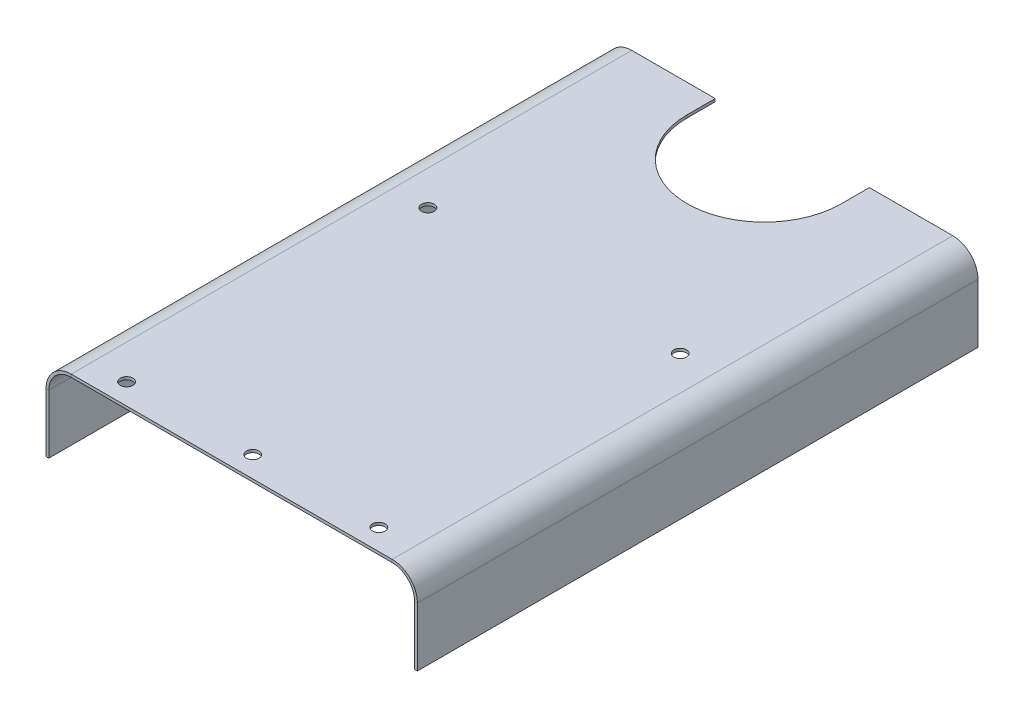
ISO-10303-21;
HEADER;
FILE_DESCRIPTION(('STEP AP214'),'2;1');
FILE_NAME('part.step','',(''),(''),'','','');
FILE_SCHEMA(('AUTOMOTIVE_DESIGN { 1 0 10303 214 1 1 1 1 }'));
ENDSEC;
DATA;
#1=APPLICATION_CONTEXT('core data for automotive mechanical design processes');
#2=APPLICATION_PROTOCOL_DEFINITION('international standard','automotive_design',2000,#1);
#3=PRODUCT_CONTEXT('',#1,'mechanical');
#4=PRODUCT('Part','Part','',(#3));
#5=PRODUCT_RELATED_PRODUCT_CATEGORY('part','',(#4));
#6=PRODUCT_DEFINITION_FORMATION('','',#4);
#7=PRODUCT_DEFINITION_CONTEXT('part definition',#1,'design');
#8=PRODUCT_DEFINITION('design','',#6,#7);
#9=PRODUCT_DEFINITION_SHAPE('','',#8);
#10=(LENGTH_UNIT() NAMED_UNIT(*) SI_UNIT(.MILLI.,.METRE.));
#11=(NAMED_UNIT(*) PLANE_ANGLE_UNIT() SI_UNIT($,.RADIAN.));
#12=(NAMED_UNIT(*) SI_UNIT($,.STERADIAN.) SOLID_ANGLE_UNIT());
#13=UNCERTAINTY_MEASURE_WITH_UNIT(LENGTH_MEASURE(1.E-05),#10,'distance_accuracy_value','');
#14=(GEOMETRIC_REPRESENTATION_CONTEXT(3) GLOBAL_UNCERTAINTY_ASSIGNED_CONTEXT((#13)) GLOBAL_UNIT_ASSIGNED_CONTEXT((#10,
#11,#12)) REPRESENTATION_CONTEXT('',''));
#15=CARTESIAN_POINT('',(0.,0.,0.));
#16=DIRECTION('',(0.,0.,1.));
#17=DIRECTION('',(1.,0.,0.));
#18=AXIS2_PLACEMENT_3D('',#15,#16,#17);
#19=CARTESIAN_POINT('',(130.5,-18.,0.));
#20=DIRECTION('',(0.,0.,-1.));
#21=DIRECTION('',(-1.,0.,0.));
#22=AXIS2_PLACEMENT_3D('',#19,#20,#21);
#23=PLANE('',#22);
#24=DIRECTION('',(-1.,0.,0.));
#25=VECTOR('',#24,1.);
#26=CARTESIAN_POINT('',(-132.5,0.,0.));
#27=LINE('',#26,#25);
#28=CARTESIAN_POINT('',(-55.,0.,0.));
#29=VERTEX_POINT('',#28);
#30=CARTESIAN_POINT('',(-114.5,0.,0.));
#31=VERTEX_POINT('',#30);
#32=EDGE_CURVE('E157',#29,#31,#27,.T.);
#33=ORIENTED_EDGE('',*,*,#32,.F.);
#34=DIRECTION('',(0.,-1.,0.));
#35=VECTOR('',#34,1.);
#36=CARTESIAN_POINT('',(-55.0000000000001,626.943183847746,0.));
#37=LINE('',#36,#35);
#38=CARTESIAN_POINT('',(-55.,-1.99999999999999,0.));
#39=VERTEX_POINT('',#38);
#40=EDGE_CURVE('E291',#29,#39,#37,.T.);
#41=ORIENTED_EDGE('',*,*,#40,.T.);
#42=DIRECTION('',(-1.,0.,0.));
#43=VECTOR('',#42,1.);
#44=CARTESIAN_POINT('',(-132.5,-2.,0.));
#45=LINE('',#44,#43);
#46=CARTESIAN_POINT('',(-114.5,-2.,0.));
#47=VERTEX_POINT('',#46);
#48=EDGE_CURVE('E241',#39,#47,#45,.T.);
#49=ORIENTED_EDGE('',*,*,#48,.T.);
#50=DIRECTION('',(0.,1.,0.));
#51=VECTOR('',#50,1.);
#52=CARTESIAN_POINT('',(-114.5,-2.,0.));
#53=LINE('',#52,#51);
#54=EDGE_CURVE('E188',#47,#31,#53,.T.);
#55=ORIENTED_EDGE('',*,*,#54,.T.);
#56=EDGE_LOOP('',(#33,#41,#49,#55));
#57=FACE_BOUND('',#56,.T.);
#58=ADVANCED_FACE('F34',(#57),#23,.T.);
#59=CARTESIAN_POINT('',(114.5,-1.99999999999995,0.));
#60=VERTEX_POINT('',#59);
#61=CARTESIAN_POINT('',(55.,-1.99999999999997,0.));
#62=VERTEX_POINT('',#61);
#63=EDGE_CURVE('E164',#60,#62,#45,.T.);
#64=ORIENTED_EDGE('',*,*,#63,.T.);
#65=DIRECTION('',(0.,-1.,0.));
#66=VECTOR('',#65,1.);
#67=CARTESIAN_POINT('',(54.9999999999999,626.943183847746,0.));
#68=LINE('',#67,#66);
#69=CARTESIAN_POINT('',(55.,0.,0.));
#70=VERTEX_POINT('',#69);
#71=EDGE_CURVE('E161',#70,#62,#68,.T.);
#72=ORIENTED_EDGE('',*,*,#71,.F.);
#73=CARTESIAN_POINT('',(114.5,0.,0.));
#74=VERTEX_POINT('',#73);
#75=EDGE_CURVE('E146',#74,#70,#27,.T.);
#76=ORIENTED_EDGE('',*,*,#75,.F.);
#77=DIRECTION('',(0.,-1.,0.));
#78=VECTOR('',#77,1.);
#79=CARTESIAN_POINT('',(114.5,0.,0.));
#80=LINE('',#79,#78);
#81=EDGE_CURVE('E178',#74,#60,#80,.T.);
#82=ORIENTED_EDGE('',*,*,#81,.T.);
#83=EDGE_LOOP('',(#64,#72,#76,#82));
#84=FACE_BOUND('',#83,.T.);
#85=ADVANCED_FACE('F162',(#84),#23,.T.);
#86=CARTESIAN_POINT('',(-132.5,-2.,400.));
#87=DIRECTION('',(0.,-1.,0.));
#88=DIRECTION('',(1.,0.,0.));
#89=AXIS2_PLACEMENT_3D('',#86,#87,#88);
#90=PLANE('',#89);
#91=CARTESIAN_POINT('',(90.,-1.99999999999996,385.));
#92=DIRECTION('',(0.,-1.,0.));
#93=DIRECTION('',(1.,0.,0.));
#94=AXIS2_PLACEMENT_3D('',#91,#92,#93);
#95=CIRCLE('',#94,4.50000000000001);
#96=CARTESIAN_POINT('',(94.5,-1.99999999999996,385.));
#97=VERTEX_POINT('',#96);
#98=EDGE_CURVE('E320',#97,#97,#95,.T.);
#99=ORIENTED_EDGE('',*,*,#98,.F.);
#100=EDGE_LOOP('',(#99));
#101=FACE_BOUND('',#100,.T.);
#102=CARTESIAN_POINT('',(0.,-1.99999999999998,385.));
#103=DIRECTION('',(0.,-1.,0.));
#104=DIRECTION('',(1.,0.,0.));
#105=AXIS2_PLACEMENT_3D('',#102,#103,#104);
#106=CIRCLE('',#105,4.50000000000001);
#107=CARTESIAN_POINT('',(4.50000000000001,-1.99999999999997,385.));
#108=VERTEX_POINT('',#107);
#109=EDGE_CURVE('E314',#108,#108,#106,.T.);
#110=ORIENTED_EDGE('',*,*,#109,.F.);
#111=EDGE_LOOP('',(#110));
#112=FACE_BOUND('',#111,.T.);
#113=CARTESIAN_POINT('',(-90.,-1.99999999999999,385.));
#114=DIRECTION('',(0.,-1.,0.));
#115=DIRECTION('',(1.,0.,0.));
#116=AXIS2_PLACEMENT_3D('',#113,#114,#115);
#117=CIRCLE('',#116,4.50000000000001);
#118=CARTESIAN_POINT('',(-85.5,-1.99999999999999,385.));
#119=VERTEX_POINT('',#118);
#120=EDGE_CURVE('E308',#119,#119,#117,.T.);
#121=ORIENTED_EDGE('',*,*,#120,.F.);
#122=EDGE_LOOP('',(#121));
#123=FACE_BOUND('',#122,.T.);
#124=CARTESIAN_POINT('',(90.,-1.99999999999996,170.));
#125=DIRECTION('',(0.,-1.,0.));
#126=DIRECTION('',(1.,0.,0.));
#127=AXIS2_PLACEMENT_3D('',#124,#125,#126);
#128=CIRCLE('',#127,4.50000000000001);
#129=CARTESIAN_POINT('',(94.5,-1.99999999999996,170.));
#130=VERTEX_POINT('',#129);
#131=EDGE_CURVE('E302',#130,#130,#128,.T.);
#132=ORIENTED_EDGE('',*,*,#131,.F.);
#133=EDGE_LOOP('',(#132));
#134=FACE_BOUND('',#133,.T.);
#135=CARTESIAN_POINT('',(-90.,-1.99999999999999,170.));
#136=DIRECTION('',(0.,-1.,0.));
#137=DIRECTION('',(1.,0.,0.));
#138=AXIS2_PLACEMENT_3D('',#135,#136,#137);
#139=CIRCLE('',#138,4.50000000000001);
#140=CARTESIAN_POINT('',(-85.5,-1.99999999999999,170.));
#141=VERTEX_POINT('',#140);
#142=EDGE_CURVE('E295',#141,#141,#139,.T.);
#143=ORIENTED_EDGE('',*,*,#142,.F.);
#144=EDGE_LOOP('',(#143));
#145=FACE_BOUND('',#144,.T.);
#146=ORIENTED_EDGE('',*,*,#48,.F.);
#147=DIRECTION('',(0.,0.,1.));
#148=VECTOR('',#147,1.);
#149=CARTESIAN_POINT('',(-55.,-1.99999999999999,400.));
#150=LINE('',#149,#148);
#151=CARTESIAN_POINT('',(-55.,-2.00000000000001,20.));
#152=VERTEX_POINT('',#151);
#153=EDGE_CURVE('E49',#39,#152,#150,.T.);
#154=ORIENTED_EDGE('',*,*,#153,.T.);
#155=CARTESIAN_POINT('',(0.,-2.,20.));
#156=DIRECTION('',(0.,-1.,0.));
#157=DIRECTION('',(1.,0.,0.));
#158=AXIS2_PLACEMENT_3D('',#155,#156,#157);
#159=CIRCLE('',#158,55.);
#160=CARTESIAN_POINT('',(55.,-1.99999999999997,20.));
#161=VERTEX_POINT('',#160);
#162=EDGE_CURVE('E53',#152,#161,#159,.F.);
#163=ORIENTED_EDGE('',*,*,#162,.T.);
#164=DIRECTION('',(0.,0.,-1.));
#165=VECTOR('',#164,1.);
#166=CARTESIAN_POINT('',(55.,-1.99999999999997,400.));
#167=LINE('',#166,#165);
#168=EDGE_CURVE('E289',#161,#62,#167,.T.);
#169=ORIENTED_EDGE('',*,*,#168,.T.);
#170=ORIENTED_EDGE('',*,*,#63,.F.);
#171=DIRECTION('',(0.,0.,-1.));
#172=VECTOR('',#171,1.);
#173=CARTESIAN_POINT('',(114.5,-1.99999999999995,400.));
#174=LINE('',#173,#172);
#175=CARTESIAN_POINT('',(114.5,-1.99999999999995,400.));
#176=VERTEX_POINT('',#175);
#177=EDGE_CURVE('E201',#176,#60,#174,.T.);
#178=ORIENTED_EDGE('',*,*,#177,.F.);
#179=DIRECTION('',(-1.,0.,0.));
#180=VECTOR('',#179,1.);
#181=CARTESIAN_POINT('',(-132.5,-2.,400.));
#182=LINE('',#181,#180);
#183=CARTESIAN_POINT('',(-114.5,-2.,400.));
#184=VERTEX_POINT('',#183);
#185=EDGE_CURVE('E274',#176,#184,#182,.T.);
#186=ORIENTED_EDGE('',*,*,#185,.T.);
#187=DIRECTION('',(0.,0.,-1.));
#188=VECTOR('',#187,1.);
#189=CARTESIAN_POINT('',(-114.5,-2.,400.));
#190=LINE('',#189,#188);
#191=EDGE_CURVE('E198',#184,#47,#190,.T.);
#192=ORIENTED_EDGE('',*,*,#191,.T.);
#193=EDGE_LOOP('',(#146,#154,#163,#169,#170,#178,#186,#192));
#194=FACE_BOUND('',#193,.T.);
#195=ADVANCED_FACE('F331',(#101,#112,#123,#134,#145,#194),#90,.T.);
#196=CARTESIAN_POINT('',(-132.5,0.,400.));
#197=DIRECTION('',(0.,-1.,0.));
#198=DIRECTION('',(1.,0.,0.));
#199=AXIS2_PLACEMENT_3D('',#196,#197,#198);
#200=PLANE('',#199);
#201=CARTESIAN_POINT('',(90.,0.,385.));
#202=DIRECTION('',(0.,1.,0.));
#203=DIRECTION('',(-1.,0.,0.));
#204=AXIS2_PLACEMENT_3D('',#201,#202,#203);
#205=CIRCLE('',#204,4.50000000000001);
#206=CARTESIAN_POINT('',(85.5,0.,385.));
#207=VERTEX_POINT('',#206);
#208=EDGE_CURVE('E323',#207,#207,#205,.T.);
#209=ORIENTED_EDGE('',*,*,#208,.F.);
#210=EDGE_LOOP('',(#209));
#211=FACE_BOUND('',#210,.T.);
#212=CARTESIAN_POINT('',(0.,0.,385.));
#213=DIRECTION('',(0.,1.,0.));
#214=DIRECTION('',(-1.,0.,0.));
#215=AXIS2_PLACEMENT_3D('',#212,#213,#214);
#216=CIRCLE('',#215,4.50000000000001);
#217=CARTESIAN_POINT('',(-4.50000000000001,0.,385.));
#218=VERTEX_POINT('',#217);
#219=EDGE_CURVE('E317',#218,#218,#216,.T.);
#220=ORIENTED_EDGE('',*,*,#219,.F.);
#221=EDGE_LOOP('',(#220));
#222=FACE_BOUND('',#221,.T.);
#223=CARTESIAN_POINT('',(-90.,0.,385.));
#224=DIRECTION('',(0.,1.,0.));
#225=DIRECTION('',(-1.,0.,0.));
#226=AXIS2_PLACEMENT_3D('',#223,#224,#225);
#227=CIRCLE('',#226,4.50000000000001);
#228=CARTESIAN_POINT('',(-94.5,0.,385.));
#229=VERTEX_POINT('',#228);
#230=EDGE_CURVE('E311',#229,#229,#227,.T.);
#231=ORIENTED_EDGE('',*,*,#230,.F.);
#232=EDGE_LOOP('',(#231));
#233=FACE_BOUND('',#232,.T.);
#234=CARTESIAN_POINT('',(90.,0.,170.));
#235=DIRECTION('',(0.,1.,0.));
#236=DIRECTION('',(-1.,0.,0.));
#237=AXIS2_PLACEMENT_3D('',#234,#235,#236);
#238=CIRCLE('',#237,4.50000000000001);
#239=CARTESIAN_POINT('',(85.5,0.,170.));
#240=VERTEX_POINT('',#239);
#241=EDGE_CURVE('E305',#240,#240,#238,.T.);
#242=ORIENTED_EDGE('',*,*,#241,.F.);
#243=EDGE_LOOP('',(#242));
#244=FACE_BOUND('',#243,.T.);
#245=CARTESIAN_POINT('',(-90.,0.,170.));
#246=DIRECTION('',(0.,1.,0.));
#247=DIRECTION('',(-1.,0.,0.));
#248=AXIS2_PLACEMENT_3D('',#245,#246,#247);
#249=CIRCLE('',#248,4.50000000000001);
#250=CARTESIAN_POINT('',(-94.5,0.,170.));
#251=VERTEX_POINT('',#250);
#252=EDGE_CURVE('E299',#251,#251,#249,.T.);
#253=ORIENTED_EDGE('',*,*,#252,.F.);
#254=EDGE_LOOP('',(#253));
#255=FACE_BOUND('',#254,.T.);
#256=DIRECTION('',(0.,0.,1.));
#257=VECTOR('',#256,1.);
#258=CARTESIAN_POINT('',(-55.,0.,400.));
#259=LINE('',#258,#257);
#260=CARTESIAN_POINT('',(-55.,0.,20.));
#261=VERTEX_POINT('',#260);
#262=EDGE_CURVE('E11',#29,#261,#259,.T.);
#263=ORIENTED_EDGE('',*,*,#262,.F.);
#264=ORIENTED_EDGE('',*,*,#32,.T.);
#265=DIRECTION('',(0.,0.,-1.));
#266=VECTOR('',#265,1.);
#267=CARTESIAN_POINT('',(-114.5,0.,400.));
#268=LINE('',#267,#266);
#269=CARTESIAN_POINT('',(-114.5,0.,400.));
#270=VERTEX_POINT('',#269);
#271=EDGE_CURVE('E215',#270,#31,#268,.T.);
#272=ORIENTED_EDGE('',*,*,#271,.F.);
#273=DIRECTION('',(-1.,0.,0.));
#274=VECTOR('',#273,1.);
#275=CARTESIAN_POINT('',(-132.5,0.,400.));
#276=LINE('',#275,#274);
#277=CARTESIAN_POINT('',(114.5,0.,400.));
#278=VERTEX_POINT('',#277);
#279=EDGE_CURVE('E256',#278,#270,#276,.T.);
#280=ORIENTED_EDGE('',*,*,#279,.F.);
#281=DIRECTION('',(0.,0.,-1.));
#282=VECTOR('',#281,1.);
#283=CARTESIAN_POINT('',(114.5,0.,400.));
#284=LINE('',#283,#282);
#285=EDGE_CURVE('E154',#278,#74,#284,.T.);
#286=ORIENTED_EDGE('',*,*,#285,.T.);
#287=ORIENTED_EDGE('',*,*,#75,.T.);
#288=DIRECTION('',(0.,0.,-1.));
#289=VECTOR('',#288,1.);
#290=CARTESIAN_POINT('',(55.,0.,400.));
#291=LINE('',#290,#289);
#292=CARTESIAN_POINT('',(55.,0.,20.));
#293=VERTEX_POINT('',#292);
#294=EDGE_CURVE('E150',#293,#70,#291,.T.);
#295=ORIENTED_EDGE('',*,*,#294,.F.);
#296=CARTESIAN_POINT('',(0.,0.,20.));
#297=DIRECTION('',(0.,-1.,0.));
#298=DIRECTION('',(1.,0.,0.));
#299=AXIS2_PLACEMENT_3D('',#296,#297,#298);
#300=CIRCLE('',#299,55.);
#301=EDGE_CURVE('E42',#261,#293,#300,.F.);
#302=ORIENTED_EDGE('',*,*,#301,.F.);
#303=EDGE_LOOP('',(#263,#264,#272,#280,#286,#287,#295,#302));
#304=FACE_BOUND('',#303,.T.);
#305=ADVANCED_FACE('F148',(#211,#222,#233,#244,#255,#304),#200,.F.);
#306=CARTESIAN_POINT('',(132.5,-18.,400.));
#307=DIRECTION('',(0.,0.,1.));
#308=DIRECTION('',(1.,0.,0.));
#309=AXIS2_PLACEMENT_3D('',#306,#307,#308);
#310=PLANE('',#309);
#311=DIRECTION('',(-1.,0.,0.));
#312=VECTOR('',#311,1.);
#313=CARTESIAN_POINT('',(132.5,-18.,400.));
#314=LINE('',#313,#312);
#315=CARTESIAN_POINT('',(132.5,-18.,400.));
#316=VERTEX_POINT('',#315);
#317=CARTESIAN_POINT('',(130.5,-18.,400.));
#318=VERTEX_POINT('',#317);
#319=EDGE_CURVE('E172',#316,#318,#314,.T.);
#320=ORIENTED_EDGE('',*,*,#319,.F.);
#321=CARTESIAN_POINT('',(114.5,-18.,400.));
#322=DIRECTION('',(0.,0.,-1.));
#323=DIRECTION('',(-1.,0.,0.));
#324=AXIS2_PLACEMENT_3D('',#321,#322,#323);
#325=CIRCLE('',#324,18.);
#326=EDGE_CURVE('E259',#316,#278,#325,.F.);
#327=ORIENTED_EDGE('',*,*,#326,.T.);
#328=DIRECTION('',(0.,1.,0.));
#329=VECTOR('',#328,1.);
#330=CARTESIAN_POINT('',(114.5,-1.99999999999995,400.));
#331=LINE('',#330,#329);
#332=EDGE_CURVE('E174',#176,#278,#331,.T.);
#333=ORIENTED_EDGE('',*,*,#332,.F.);
#334=CARTESIAN_POINT('',(114.5,-18.,400.));
#335=DIRECTION('',(0.,0.,1.));
#336=DIRECTION('',(1.,0.,0.));
#337=AXIS2_PLACEMENT_3D('',#334,#335,#336);
#338=CIRCLE('',#337,16.);
#339=EDGE_CURVE('E271',#318,#176,#338,.T.);
#340=ORIENTED_EDGE('',*,*,#339,.F.);
#341=EDGE_LOOP('',(#320,#327,#333,#340));
#342=FACE_BOUND('',#341,.T.);
#343=ADVANCED_FACE('F36',(#342),#310,.T.);
#344=CARTESIAN_POINT('',(114.5,-1.99999999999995,400.));
#345=DIRECTION('',(0.,0.,1.));
#346=DIRECTION('',(1.,0.,0.));
#347=AXIS2_PLACEMENT_3D('',#344,#345,#346);
#348=PLANE('',#347);
#349=DIRECTION('',(0.,1.,0.));
#350=VECTOR('',#349,1.);
#351=CARTESIAN_POINT('',(132.5,0.,400.));
#352=LINE('',#351,#350);
#353=CARTESIAN_POINT('',(132.5,-60.,400.));
#354=VERTEX_POINT('',#353);
#355=EDGE_CURVE('E262',#354,#316,#352,.T.);
#356=ORIENTED_EDGE('',*,*,#355,.T.);
#357=ORIENTED_EDGE('',*,*,#319,.T.);
#358=DIRECTION('',(0.,1.,0.));
#359=VECTOR('',#358,1.);
#360=CARTESIAN_POINT('',(130.5,0.,400.));
#361=LINE('',#360,#359);
#362=CARTESIAN_POINT('',(130.5,-60.,400.));
#363=VERTEX_POINT('',#362);
#364=EDGE_CURVE('E268',#363,#318,#361,.T.);
#365=ORIENTED_EDGE('',*,*,#364,.F.);
#366=DIRECTION('',(-1.,0.,0.));
#367=VECTOR('',#366,1.);
#368=CARTESIAN_POINT('',(132.5,-60.,400.));
#369=LINE('',#368,#367);
#370=EDGE_CURVE('E265',#354,#363,#369,.T.);
#371=ORIENTED_EDGE('',*,*,#370,.F.);
#372=EDGE_LOOP('',(#356,#357,#365,#371));
#373=FACE_BOUND('',#372,.T.);
#374=ADVANCED_FACE('F368',(#373),#348,.T.);
#375=CARTESIAN_POINT('',(114.5,0.,0.));
#376=DIRECTION('',(0.,0.,-1.));
#377=DIRECTION('',(-1.,0.,0.));
#378=AXIS2_PLACEMENT_3D('',#375,#376,#377);
#379=PLANE('',#378);
#380=ORIENTED_EDGE('',*,*,#81,.F.);
#381=CARTESIAN_POINT('',(114.5,-18.,0.));
#382=DIRECTION('',(0.,0.,-1.));
#383=DIRECTION('',(-1.,0.,0.));
#384=AXIS2_PLACEMENT_3D('',#381,#382,#383);
#385=CIRCLE('',#384,18.);
#386=CARTESIAN_POINT('',(132.5,-18.,0.));
#387=VERTEX_POINT('',#386);
#388=EDGE_CURVE('E225',#387,#74,#385,.F.);
#389=ORIENTED_EDGE('',*,*,#388,.F.);
#390=DIRECTION('',(1.,0.,0.));
#391=VECTOR('',#390,1.);
#392=CARTESIAN_POINT('',(130.5,-18.,0.));
#393=LINE('',#392,#391);
#394=CARTESIAN_POINT('',(130.5,-18.,0.));
#395=VERTEX_POINT('',#394);
#396=EDGE_CURVE('E180',#395,#387,#393,.T.);
#397=ORIENTED_EDGE('',*,*,#396,.F.);
#398=CARTESIAN_POINT('',(114.5,-18.,0.));
#399=DIRECTION('',(0.,0.,1.));
#400=DIRECTION('',(1.,0.,0.));
#401=AXIS2_PLACEMENT_3D('',#398,#399,#400);
#402=CIRCLE('',#401,16.);
#403=EDGE_CURVE('E237',#395,#60,#402,.T.);
#404=ORIENTED_EDGE('',*,*,#403,.T.);
#405=EDGE_LOOP('',(#380,#389,#397,#404));
#406=FACE_BOUND('',#405,.T.);
#407=ADVANCED_FACE('F366',(#406),#379,.T.);
#408=CARTESIAN_POINT('',(-114.5,0.,400.));
#409=DIRECTION('',(0.,0.,1.));
#410=DIRECTION('',(1.,0.,0.));
#411=AXIS2_PLACEMENT_3D('',#408,#409,#410);
#412=PLANE('',#411);
#413=DIRECTION('',(0.,-1.,0.));
#414=VECTOR('',#413,1.);
#415=CARTESIAN_POINT('',(-114.5,0.,400.));
#416=LINE('',#415,#414);
#417=EDGE_CURVE('E182',#270,#184,#416,.T.);
#418=ORIENTED_EDGE('',*,*,#417,.F.);
#419=CARTESIAN_POINT('',(-114.5,-18.,400.));
#420=DIRECTION('',(0.,0.,-1.));
#421=DIRECTION('',(-1.,0.,0.));
#422=AXIS2_PLACEMENT_3D('',#419,#420,#421);
#423=CIRCLE('',#422,18.);
#424=CARTESIAN_POINT('',(-132.5,-18.,400.));
#425=VERTEX_POINT('',#424);
#426=EDGE_CURVE('E221',#270,#425,#423,.F.);
#427=ORIENTED_EDGE('',*,*,#426,.T.);
#428=DIRECTION('',(-1.,0.,0.));
#429=VECTOR('',#428,1.);
#430=CARTESIAN_POINT('',(-130.5,-18.,400.));
#431=LINE('',#430,#429);
#432=CARTESIAN_POINT('',(-130.5,-18.,400.));
#433=VERTEX_POINT('',#432);
#434=EDGE_CURVE('E184',#433,#425,#431,.T.);
#435=ORIENTED_EDGE('',*,*,#434,.F.);
#436=CARTESIAN_POINT('',(-114.5,-18.,400.));
#437=DIRECTION('',(0.,0.,1.));
#438=DIRECTION('',(1.,0.,0.));
#439=AXIS2_PLACEMENT_3D('',#436,#437,#438);
#440=CIRCLE('',#439,16.);
#441=EDGE_CURVE('E277',#184,#433,#440,.T.);
#442=ORIENTED_EDGE('',*,*,#441,.F.);
#443=EDGE_LOOP('',(#418,#427,#435,#442));
#444=FACE_BOUND('',#443,.T.);
#445=ADVANCED_FACE('F364',(#444),#412,.T.);
#446=CARTESIAN_POINT('',(-130.5,-18.,400.));
#447=DIRECTION('',(0.,0.,1.));
#448=DIRECTION('',(1.,0.,0.));
#449=AXIS2_PLACEMENT_3D('',#446,#447,#448);
#450=PLANE('',#449);
#451=ORIENTED_EDGE('',*,*,#279,.T.);
#452=ORIENTED_EDGE('',*,*,#417,.T.);
#453=ORIENTED_EDGE('',*,*,#185,.F.);
#454=ORIENTED_EDGE('',*,*,#332,.T.);
#455=EDGE_LOOP('',(#451,#452,#453,#454));
#456=FACE_BOUND('',#455,.T.);
#457=ADVANCED_FACE('F424',(#456),#450,.T.);
#458=CARTESIAN_POINT('',(-132.5,-18.,0.));
#459=DIRECTION('',(0.,0.,-1.));
#460=DIRECTION('',(-1.,0.,0.));
#461=AXIS2_PLACEMENT_3D('',#458,#459,#460);
#462=PLANE('',#461);
#463=DIRECTION('',(1.,0.,0.));
#464=VECTOR('',#463,1.);
#465=CARTESIAN_POINT('',(-132.5,-18.,0.));
#466=LINE('',#465,#464);
#467=CARTESIAN_POINT('',(-132.5,-18.,0.));
#468=VERTEX_POINT('',#467);
#469=CARTESIAN_POINT('',(-130.5,-18.,0.));
#470=VERTEX_POINT('',#469);
#471=EDGE_CURVE('E186',#468,#470,#466,.T.);
#472=ORIENTED_EDGE('',*,*,#471,.F.);
#473=CARTESIAN_POINT('',(-114.5,-18.,0.));
#474=DIRECTION('',(0.,0.,-1.));
#475=DIRECTION('',(-1.,0.,0.));
#476=AXIS2_PLACEMENT_3D('',#473,#474,#475);
#477=CIRCLE('',#476,18.);
#478=EDGE_CURVE('E156',#31,#468,#477,.F.);
#479=ORIENTED_EDGE('',*,*,#478,.F.);
#480=ORIENTED_EDGE('',*,*,#54,.F.);
#481=CARTESIAN_POINT('',(-114.5,-18.,0.));
#482=DIRECTION('',(0.,0.,1.));
#483=DIRECTION('',(1.,0.,0.));
#484=AXIS2_PLACEMENT_3D('',#481,#482,#483);
#485=CIRCLE('',#484,16.);
#486=EDGE_CURVE('E242',#47,#470,#485,.T.);
#487=ORIENTED_EDGE('',*,*,#486,.T.);
#488=EDGE_LOOP('',(#472,#479,#480,#487));
#489=FACE_BOUND('',#488,.T.);
#490=ADVANCED_FACE('F416',(#489),#462,.T.);
#491=CARTESIAN_POINT('',(-114.5,-2.,0.));
#492=DIRECTION('',(0.,0.,-1.));
#493=DIRECTION('',(-1.,0.,0.));
#494=AXIS2_PLACEMENT_3D('',#491,#492,#493);
#495=PLANE('',#494);
#496=DIRECTION('',(0.,-1.,0.));
#497=VECTOR('',#496,1.);
#498=CARTESIAN_POINT('',(-132.5,0.,0.));
#499=LINE('',#498,#497);
#500=CARTESIAN_POINT('',(-132.5,-60.,0.));
#501=VERTEX_POINT('',#500);
#502=EDGE_CURVE('E251',#468,#501,#499,.T.);
#503=ORIENTED_EDGE('',*,*,#502,.F.);
#504=ORIENTED_EDGE('',*,*,#471,.T.);
#505=DIRECTION('',(0.,1.,0.));
#506=VECTOR('',#505,1.);
#507=CARTESIAN_POINT('',(-130.5,0.,0.));
#508=LINE('',#507,#506);
#509=CARTESIAN_POINT('',(-130.5,-60.,0.));
#510=VERTEX_POINT('',#509);
#511=EDGE_CURVE('E245',#470,#510,#508,.F.);
#512=ORIENTED_EDGE('',*,*,#511,.T.);
#513=DIRECTION('',(-1.,0.,0.));
#514=VECTOR('',#513,1.);
#515=CARTESIAN_POINT('',(-130.5,-60.,0.));
#516=LINE('',#515,#514);
#517=EDGE_CURVE('E248',#510,#501,#516,.T.);
#518=ORIENTED_EDGE('',*,*,#517,.T.);
#519=EDGE_LOOP('',(#503,#504,#512,#518));
#520=FACE_BOUND('',#519,.T.);
#521=ADVANCED_FACE('F439',(#520),#495,.T.);
#522=CARTESIAN_POINT('',(-132.5,0.,400.));
#523=DIRECTION('',(1.,0.,0.));
#524=DIRECTION('',(0.,0.,-1.));
#525=AXIS2_PLACEMENT_3D('',#522,#523,#524);
#526=PLANE('',#525);
#527=ORIENTED_EDGE('',*,*,#502,.T.);
#528=DIRECTION('',(0.,0.,-1.));
#529=VECTOR('',#528,1.);
#530=CARTESIAN_POINT('',(-132.5,-60.,400.));
#531=LINE('',#530,#529);
#532=CARTESIAN_POINT('',(-132.5,-60.,400.));
#533=VERTEX_POINT('',#532);
#534=EDGE_CURVE('E191',#533,#501,#531,.T.);
#535=ORIENTED_EDGE('',*,*,#534,.F.);
#536=DIRECTION('',(0.,-1.,0.));
#537=VECTOR('',#536,1.);
#538=CARTESIAN_POINT('',(-132.5,0.,400.));
#539=LINE('',#538,#537);
#540=EDGE_CURVE('E223',#425,#533,#539,.T.);
#541=ORIENTED_EDGE('',*,*,#540,.F.);
#542=DIRECTION('',(0.,0.,-1.));
#543=VECTOR('',#542,1.);
#544=CARTESIAN_POINT('',(-132.5,-18.,400.));
#545=LINE('',#544,#543);
#546=EDGE_CURVE('E218',#425,#468,#545,.T.);
#547=ORIENTED_EDGE('',*,*,#546,.T.);
#548=EDGE_LOOP('',(#527,#535,#541,#547));
#549=FACE_BOUND('',#548,.T.);
#550=ADVANCED_FACE('F441',(#549),#526,.F.);
#551=CARTESIAN_POINT('',(-130.5,-60.,400.));
#552=DIRECTION('',(0.,-1.,0.));
#553=DIRECTION('',(0.,0.,-1.));
#554=AXIS2_PLACEMENT_3D('',#551,#552,#553);
#555=PLANE('',#554);
#556=ORIENTED_EDGE('',*,*,#517,.F.);
#557=DIRECTION('',(0.,0.,-1.));
#558=VECTOR('',#557,1.);
#559=CARTESIAN_POINT('',(-130.5,-60.,400.));
#560=LINE('',#559,#558);
#561=CARTESIAN_POINT('',(-130.5,-60.,400.));
#562=VERTEX_POINT('',#561);
#563=EDGE_CURVE('E193',#562,#510,#560,.T.);
#564=ORIENTED_EDGE('',*,*,#563,.F.);
#565=DIRECTION('',(-1.,0.,0.));
#566=VECTOR('',#565,1.);
#567=CARTESIAN_POINT('',(-130.5,-60.,400.));
#568=LINE('',#567,#566);
#569=EDGE_CURVE('E283',#562,#533,#568,.T.);
#570=ORIENTED_EDGE('',*,*,#569,.T.);
#571=ORIENTED_EDGE('',*,*,#534,.T.);
#572=EDGE_LOOP('',(#556,#564,#570,#571));
#573=FACE_BOUND('',#572,.T.);
#574=ADVANCED_FACE('F436',(#573),#555,.T.);
#575=CARTESIAN_POINT('',(-130.5,0.,400.));
#576=DIRECTION('',(1.,0.,0.));
#577=DIRECTION('',(0.,0.,-1.));
#578=AXIS2_PLACEMENT_3D('',#575,#576,#577);
#579=PLANE('',#578);
#580=ORIENTED_EDGE('',*,*,#511,.F.);
#581=DIRECTION('',(0.,0.,-1.));
#582=VECTOR('',#581,1.);
#583=CARTESIAN_POINT('',(-130.5,-18.,400.));
#584=LINE('',#583,#582);
#585=EDGE_CURVE('E195',#433,#470,#584,.T.);
#586=ORIENTED_EDGE('',*,*,#585,.F.);
#587=DIRECTION('',(0.,1.,0.));
#588=VECTOR('',#587,1.);
#589=CARTESIAN_POINT('',(-130.5,0.,400.));
#590=LINE('',#589,#588);
#591=EDGE_CURVE('E280',#433,#562,#590,.F.);
#592=ORIENTED_EDGE('',*,*,#591,.T.);
#593=ORIENTED_EDGE('',*,*,#563,.T.);
#594=EDGE_LOOP('',(#580,#586,#592,#593));
#595=FACE_BOUND('',#594,.T.);
#596=ADVANCED_FACE('F429',(#595),#579,.T.);
#597=CARTESIAN_POINT('',(-114.5,-18.,400.));
#598=DIRECTION('',(0.,0.,-1.));
#599=DIRECTION('',(-1.,0.,0.));
#600=AXIS2_PLACEMENT_3D('',#597,#598,#599);
#601=CYLINDRICAL_SURFACE('',#600,16.);
#602=ORIENTED_EDGE('',*,*,#486,.F.);
#603=ORIENTED_EDGE('',*,*,#191,.F.);
#604=ORIENTED_EDGE('',*,*,#441,.T.);
#605=ORIENTED_EDGE('',*,*,#585,.T.);
#606=EDGE_LOOP('',(#602,#603,#604,#605));
#607=FACE_BOUND('',#606,.T.);
#608=ADVANCED_FACE('F412',(#607),#601,.F.);
#609=CARTESIAN_POINT('',(114.5,-18.,400.));
#610=DIRECTION('',(0.,0.,-1.));
#611=DIRECTION('',(-1.,0.,0.));
#612=AXIS2_PLACEMENT_3D('',#609,#610,#611);
#613=CYLINDRICAL_SURFACE('',#612,16.);
#614=ORIENTED_EDGE('',*,*,#403,.F.);
#615=DIRECTION('',(0.,0.,-1.));
#616=VECTOR('',#615,1.);
#617=CARTESIAN_POINT('',(130.5,-18.,400.));
#618=LINE('',#617,#616);
#619=EDGE_CURVE('E204',#318,#395,#618,.T.);
#620=ORIENTED_EDGE('',*,*,#619,.F.);
#621=ORIENTED_EDGE('',*,*,#339,.T.);
#622=ORIENTED_EDGE('',*,*,#177,.T.);
#623=EDGE_LOOP('',(#614,#620,#621,#622));
#624=FACE_BOUND('',#623,.T.);
#625=ADVANCED_FACE('F400',(#624),#613,.F.);
#626=CARTESIAN_POINT('',(130.5,0.,400.));
#627=DIRECTION('',(-1.,0.,0.));
#628=DIRECTION('',(0.,0.,1.));
#629=AXIS2_PLACEMENT_3D('',#626,#627,#628);
#630=PLANE('',#629);
#631=DIRECTION('',(0.,1.,0.));
#632=VECTOR('',#631,1.);
#633=CARTESIAN_POINT('',(130.5,0.,0.));
#634=LINE('',#633,#632);
#635=CARTESIAN_POINT('',(130.5,-60.,0.));
#636=VERTEX_POINT('',#635);
#637=EDGE_CURVE('E234',#636,#395,#634,.T.);
#638=ORIENTED_EDGE('',*,*,#637,.F.);
#639=DIRECTION('',(0.,0.,-1.));
#640=VECTOR('',#639,1.);
#641=CARTESIAN_POINT('',(130.5,-60.,400.));
#642=LINE('',#641,#640);
#643=EDGE_CURVE('E207',#363,#636,#642,.T.);
#644=ORIENTED_EDGE('',*,*,#643,.F.);
#645=ORIENTED_EDGE('',*,*,#364,.T.);
#646=ORIENTED_EDGE('',*,*,#619,.T.);
#647=EDGE_LOOP('',(#638,#644,#645,#646));
#648=FACE_BOUND('',#647,.T.);
#649=ADVANCED_FACE('F393',(#648),#630,.T.);
#650=CARTESIAN_POINT('',(132.5,-60.,400.));
#651=DIRECTION('',(0.,-1.,0.));
#652=DIRECTION('',(0.,0.,-1.));
#653=AXIS2_PLACEMENT_3D('',#650,#651,#652);
#654=PLANE('',#653);
#655=DIRECTION('',(-1.,0.,0.));
#656=VECTOR('',#655,1.);
#657=CARTESIAN_POINT('',(132.5,-60.,0.));
#658=LINE('',#657,#656);
#659=CARTESIAN_POINT('',(132.5,-60.,0.));
#660=VERTEX_POINT('',#659);
#661=EDGE_CURVE('E231',#660,#636,#658,.T.);
#662=ORIENTED_EDGE('',*,*,#661,.F.);
#663=DIRECTION('',(0.,0.,-1.));
#664=VECTOR('',#663,1.);
#665=CARTESIAN_POINT('',(132.5,-60.,400.));
#666=LINE('',#665,#664);
#667=EDGE_CURVE('E209',#354,#660,#666,.T.);
#668=ORIENTED_EDGE('',*,*,#667,.F.);
#669=ORIENTED_EDGE('',*,*,#370,.T.);
#670=ORIENTED_EDGE('',*,*,#643,.T.);
#671=EDGE_LOOP('',(#662,#668,#669,#670));
#672=FACE_BOUND('',#671,.T.);
#673=ADVANCED_FACE('F397',(#672),#654,.T.);
#674=CARTESIAN_POINT('',(132.5,0.,400.));
#675=DIRECTION('',(-1.,0.,0.));
#676=DIRECTION('',(0.,0.,1.));
#677=AXIS2_PLACEMENT_3D('',#674,#675,#676);
#678=PLANE('',#677);
#679=DIRECTION('',(0.,1.,0.));
#680=VECTOR('',#679,1.);
#681=CARTESIAN_POINT('',(132.5,0.,0.));
#682=LINE('',#681,#680);
#683=EDGE_CURVE('E228',#660,#387,#682,.T.);
#684=ORIENTED_EDGE('',*,*,#683,.T.);
#685=DIRECTION('',(0.,0.,-1.));
#686=VECTOR('',#685,1.);
#687=CARTESIAN_POINT('',(132.5,-18.,400.));
#688=LINE('',#687,#686);
#689=EDGE_CURVE('E211',#316,#387,#688,.T.);
#690=ORIENTED_EDGE('',*,*,#689,.F.);
#691=ORIENTED_EDGE('',*,*,#355,.F.);
#692=ORIENTED_EDGE('',*,*,#667,.T.);
#693=EDGE_LOOP('',(#684,#690,#691,#692));
#694=FACE_BOUND('',#693,.T.);
#695=ADVANCED_FACE('F383',(#694),#678,.F.);
#696=CARTESIAN_POINT('',(114.5,-18.,400.));
#697=DIRECTION('',(0.,0.,-1.));
#698=DIRECTION('',(-1.,0.,0.));
#699=AXIS2_PLACEMENT_3D('',#696,#697,#698);
#700=CYLINDRICAL_SURFACE('',#699,18.);
#701=ORIENTED_EDGE('',*,*,#388,.T.);
#702=ORIENTED_EDGE('',*,*,#285,.F.);
#703=ORIENTED_EDGE('',*,*,#326,.F.);
#704=ORIENTED_EDGE('',*,*,#689,.T.);
#705=EDGE_LOOP('',(#701,#702,#703,#704));
#706=FACE_BOUND('',#705,.T.);
#707=ADVANCED_FACE('F387',(#706),#700,.T.);
#708=CARTESIAN_POINT('',(-114.5,-18.,400.));
#709=DIRECTION('',(0.,0.,-1.));
#710=DIRECTION('',(-1.,0.,0.));
#711=AXIS2_PLACEMENT_3D('',#708,#709,#710);
#712=CYLINDRICAL_SURFACE('',#711,18.);
#713=ORIENTED_EDGE('',*,*,#478,.T.);
#714=ORIENTED_EDGE('',*,*,#546,.F.);
#715=ORIENTED_EDGE('',*,*,#426,.F.);
#716=ORIENTED_EDGE('',*,*,#271,.T.);
#717=EDGE_LOOP('',(#713,#714,#715,#716));
#718=FACE_BOUND('',#717,.T.);
#719=ADVANCED_FACE('F421',(#718),#712,.T.);
#720=CARTESIAN_POINT('',(-114.5,-18.,400.));
#721=DIRECTION('',(0.,0.,1.));
#722=DIRECTION('',(1.,0.,0.));
#723=AXIS2_PLACEMENT_3D('',#720,#721,#722);
#724=PLANE('',#723);
#725=ORIENTED_EDGE('',*,*,#540,.T.);
#726=ORIENTED_EDGE('',*,*,#569,.F.);
#727=ORIENTED_EDGE('',*,*,#591,.F.);
#728=ORIENTED_EDGE('',*,*,#434,.T.);
#729=EDGE_LOOP('',(#725,#726,#727,#728));
#730=FACE_BOUND('',#729,.T.);
#731=ADVANCED_FACE('F431',(#730),#724,.T.);
#732=CARTESIAN_POINT('',(-114.5,-18.,0.));
#733=DIRECTION('',(0.,0.,1.));
#734=DIRECTION('',(1.,0.,0.));
#735=AXIS2_PLACEMENT_3D('',#732,#733,#734);
#736=PLANE('',#735);
#737=ORIENTED_EDGE('',*,*,#637,.T.);
#738=ORIENTED_EDGE('',*,*,#396,.T.);
#739=ORIENTED_EDGE('',*,*,#683,.F.);
#740=ORIENTED_EDGE('',*,*,#661,.T.);
#741=EDGE_LOOP('',(#737,#738,#739,#740));
#742=FACE_BOUND('',#741,.T.);
#743=ADVANCED_FACE('F399',(#742),#736,.F.);
#744=CARTESIAN_POINT('',(-55.0000000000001,626.943183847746,20.));
#745=DIRECTION('',(1.,0.,0.));
#746=DIRECTION('',(0.,1.,0.));
#747=AXIS2_PLACEMENT_3D('',#744,#745,#746);
#748=PLANE('',#747);
#749=ORIENTED_EDGE('',*,*,#153,.F.);
#750=ORIENTED_EDGE('',*,*,#40,.F.);
#751=ORIENTED_EDGE('',*,*,#262,.T.);
#752=DIRECTION('',(0.,-1.,0.));
#753=VECTOR('',#752,1.);
#754=CARTESIAN_POINT('',(-55.0000000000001,626.943183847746,20.));
#755=LINE('',#754,#753);
#756=EDGE_CURVE('E166',#261,#152,#755,.T.);
#757=ORIENTED_EDGE('',*,*,#756,.T.);
#758=EDGE_LOOP('',(#749,#750,#751,#757));
#759=FACE_BOUND('',#758,.T.);
#760=ADVANCED_FACE('F406',(#759),#748,.T.);
#761=CARTESIAN_POINT('',(-1.15167594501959E-13,626.943183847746,20.));
#762=DIRECTION('',(0.,-1.,0.));
#763=DIRECTION('',(1.,0.,0.));
#764=AXIS2_PLACEMENT_3D('',#761,#762,#763);
#765=CYLINDRICAL_SURFACE('',#764,55.);
#766=ORIENTED_EDGE('',*,*,#162,.F.);
#767=ORIENTED_EDGE('',*,*,#756,.F.);
#768=ORIENTED_EDGE('',*,*,#301,.T.);
#769=DIRECTION('',(0.,-1.,0.));
#770=VECTOR('',#769,1.);
#771=CARTESIAN_POINT('',(54.9999999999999,626.943183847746,20.));
#772=LINE('',#771,#770);
#773=EDGE_CURVE('E167',#293,#161,#772,.T.);
#774=ORIENTED_EDGE('',*,*,#773,.T.);
#775=EDGE_LOOP('',(#766,#767,#768,#774));
#776=FACE_BOUND('',#775,.T.);
#777=ADVANCED_FACE('F353',(#776),#765,.F.);
#778=CARTESIAN_POINT('',(54.9999999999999,626.943183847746,20.));
#779=DIRECTION('',(-1.,0.,0.));
#780=DIRECTION('',(0.,-1.,0.));
#781=AXIS2_PLACEMENT_3D('',#778,#779,#780);
#782=PLANE('',#781);
#783=ORIENTED_EDGE('',*,*,#168,.F.);
#784=ORIENTED_EDGE('',*,*,#773,.F.);
#785=ORIENTED_EDGE('',*,*,#294,.T.);
#786=ORIENTED_EDGE('',*,*,#71,.T.);
#787=EDGE_LOOP('',(#783,#784,#785,#786));
#788=FACE_BOUND('',#787,.T.);
#789=ADVANCED_FACE('F170',(#788),#782,.T.);
#790=CARTESIAN_POINT('',(-90.,-10.,170.));
#791=DIRECTION('',(0.,1.,0.));
#792=DIRECTION('',(-1.,0.,0.));
#793=AXIS2_PLACEMENT_3D('',#790,#791,#792);
#794=CYLINDRICAL_SURFACE('',#793,4.50000000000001);
#795=ORIENTED_EDGE('',*,*,#142,.T.);
#796=EDGE_LOOP('',(#795));
#797=FACE_BOUND('',#796,.T.);
#798=ORIENTED_EDGE('',*,*,#252,.T.);
#799=EDGE_LOOP('',(#798));
#800=FACE_BOUND('',#799,.T.);
#801=ADVANCED_FACE('F341',(#797,#800),#794,.F.);
#802=CARTESIAN_POINT('',(90.,-9.99999999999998,170.));
#803=DIRECTION('',(0.,1.,0.));
#804=DIRECTION('',(-1.,0.,0.));
#805=AXIS2_PLACEMENT_3D('',#802,#803,#804);
#806=CYLINDRICAL_SURFACE('',#805,4.50000000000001);
#807=ORIENTED_EDGE('',*,*,#131,.T.);
#808=EDGE_LOOP('',(#807));
#809=FACE_BOUND('',#808,.T.);
#810=ORIENTED_EDGE('',*,*,#241,.T.);
#811=EDGE_LOOP('',(#810));
#812=FACE_BOUND('',#811,.T.);
#813=ADVANCED_FACE('F343',(#809,#812),#806,.F.);
#814=CARTESIAN_POINT('',(-90.,-10.,385.));
#815=DIRECTION('',(0.,1.,0.));
#816=DIRECTION('',(-1.,0.,0.));
#817=AXIS2_PLACEMENT_3D('',#814,#815,#816);
#818=CYLINDRICAL_SURFACE('',#817,4.50000000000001);
#819=ORIENTED_EDGE('',*,*,#120,.T.);
#820=EDGE_LOOP('',(#819));
#821=FACE_BOUND('',#820,.T.);
#822=ORIENTED_EDGE('',*,*,#230,.T.);
#823=EDGE_LOOP('',(#822));
#824=FACE_BOUND('',#823,.T.);
#825=ADVANCED_FACE('F350',(#821,#824),#818,.F.);
#826=CARTESIAN_POINT('',(0.,-10.,385.));
#827=DIRECTION('',(0.,1.,0.));
#828=DIRECTION('',(-1.,0.,0.));
#829=AXIS2_PLACEMENT_3D('',#826,#827,#828);
#830=CYLINDRICAL_SURFACE('',#829,4.50000000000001);
#831=ORIENTED_EDGE('',*,*,#109,.T.);
#832=EDGE_LOOP('',(#831));
#833=FACE_BOUND('',#832,.T.);
#834=ORIENTED_EDGE('',*,*,#219,.T.);
#835=EDGE_LOOP('',(#834));
#836=FACE_BOUND('',#835,.T.);
#837=ADVANCED_FACE('F548',(#833,#836),#830,.F.);
#838=CARTESIAN_POINT('',(90.,-9.99999999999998,385.));
#839=DIRECTION('',(0.,1.,0.));
#840=DIRECTION('',(-1.,0.,0.));
#841=AXIS2_PLACEMENT_3D('',#838,#839,#840);
#842=CYLINDRICAL_SURFACE('',#841,4.50000000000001);
#843=ORIENTED_EDGE('',*,*,#98,.T.);
#844=EDGE_LOOP('',(#843));
#845=FACE_BOUND('',#844,.T.);
#846=ORIENTED_EDGE('',*,*,#208,.T.);
#847=EDGE_LOOP('',(#846));
#848=FACE_BOUND('',#847,.T.);
#849=ADVANCED_FACE('F327',(#845,#848),#842,.F.);
#850=CLOSED_SHELL('',(#58,#85,#195,#305,#343,#374,#407,#445,#457,#490,#521,#550,#574,#596,#608,
#625,#649,#673,#695,#707,#719,#731,#743,#760,#777,#789,#801,#813,#825,#837,#849));
#851=MANIFOLD_SOLID_BREP('B2',#850);
#852=ADVANCED_BREP_SHAPE_REPRESENTATION('',(#18,#851),#14);
#853=SHAPE_DEFINITION_REPRESENTATION(#9,#852);
ENDSEC;
END-ISO-10303-21;
